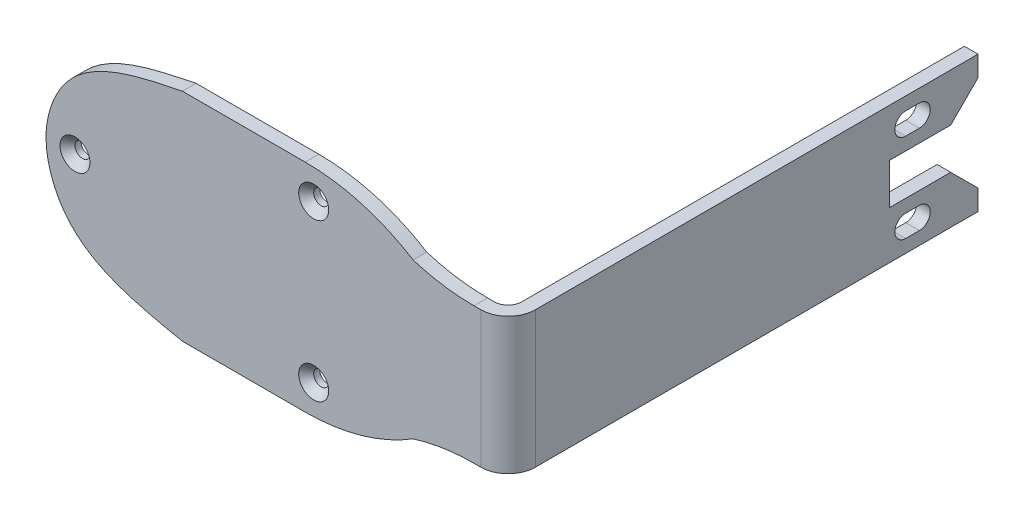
ISO-10303-21;
HEADER;
FILE_DESCRIPTION(('STEP AP214'),'2;1');
FILE_NAME('part.step','',(''),(''),'','','');
FILE_SCHEMA(('AUTOMOTIVE_DESIGN { 1 0 10303 214 1 1 1 1 }'));
ENDSEC;
DATA;
#1=APPLICATION_CONTEXT('core data for automotive mechanical design processes');
#2=APPLICATION_PROTOCOL_DEFINITION('international standard','automotive_design',2000,#1);
#3=PRODUCT_CONTEXT('',#1,'mechanical');
#4=PRODUCT('Part','Part','',(#3));
#5=PRODUCT_RELATED_PRODUCT_CATEGORY('part','',(#4));
#6=PRODUCT_DEFINITION_FORMATION('','',#4);
#7=PRODUCT_DEFINITION_CONTEXT('part definition',#1,'design');
#8=PRODUCT_DEFINITION('design','',#6,#7);
#9=PRODUCT_DEFINITION_SHAPE('','',#8);
#10=(LENGTH_UNIT() NAMED_UNIT(*) SI_UNIT(.MILLI.,.METRE.));
#11=(NAMED_UNIT(*) PLANE_ANGLE_UNIT() SI_UNIT($,.RADIAN.));
#12=(NAMED_UNIT(*) SI_UNIT($,.STERADIAN.) SOLID_ANGLE_UNIT());
#13=UNCERTAINTY_MEASURE_WITH_UNIT(LENGTH_MEASURE(1.E-05),#10,'distance_accuracy_value','');
#14=(GEOMETRIC_REPRESENTATION_CONTEXT(3) GLOBAL_UNCERTAINTY_ASSIGNED_CONTEXT((#13)) GLOBAL_UNIT_ASSIGNED_CONTEXT((#10,
#11,#12)) REPRESENTATION_CONTEXT('',''));
#15=CARTESIAN_POINT('',(0.,0.,0.));
#16=DIRECTION('',(0.,0.,1.));
#17=DIRECTION('',(1.,0.,0.));
#18=AXIS2_PLACEMENT_3D('',#15,#16,#17);
#19=CARTESIAN_POINT('',(-137.320474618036,17.986008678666,-66.9));
#20=DIRECTION('',(0.,0.,-1.));
#21=DIRECTION('',(-1.,0.,0.));
#22=AXIS2_PLACEMENT_3D('',#19,#20,#21);
#23=PLANE('',#22);
#24=DIRECTION('',(-1.,0.,0.));
#25=VECTOR('',#24,1.);
#26=CARTESIAN_POINT('',(-137.320474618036,20.9860086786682,-66.9));
#27=LINE('',#26,#25);
#28=CARTESIAN_POINT('',(-135.320474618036,20.9860086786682,-66.9));
#29=VERTEX_POINT('',#28);
#30=CARTESIAN_POINT('',(-137.320474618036,20.9860086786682,-66.9));
#31=VERTEX_POINT('',#30);
#32=EDGE_CURVE('E234',#29,#31,#27,.T.);
#33=ORIENTED_EDGE('',*,*,#32,.F.);
#34=DIRECTION('',(0.,1.,0.));
#35=VECTOR('',#34,1.);
#36=CARTESIAN_POINT('',(-135.320474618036,17.986008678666,-66.9));
#37=LINE('',#36,#35);
#38=CARTESIAN_POINT('',(-135.320474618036,17.986008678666,-66.9));
#39=VERTEX_POINT('',#38);
#40=EDGE_CURVE('E252',#39,#29,#37,.T.);
#41=ORIENTED_EDGE('',*,*,#40,.F.);
#42=DIRECTION('',(-1.,0.,0.));
#43=VECTOR('',#42,1.);
#44=CARTESIAN_POINT('',(-137.320474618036,17.986008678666,-66.9));
#45=LINE('',#44,#43);
#46=CARTESIAN_POINT('',(-137.320474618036,17.986008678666,-66.9));
#47=VERTEX_POINT('',#46);
#48=EDGE_CURVE('E253',#39,#47,#45,.T.);
#49=ORIENTED_EDGE('',*,*,#48,.T.);
#50=DIRECTION('',(0.,1.,0.));
#51=VECTOR('',#50,1.);
#52=CARTESIAN_POINT('',(-137.320474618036,17.986008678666,-66.9));
#53=LINE('',#52,#51);
#54=EDGE_CURVE('E261',#47,#31,#53,.T.);
#55=ORIENTED_EDGE('',*,*,#54,.T.);
#56=EDGE_LOOP('',(#33,#41,#49,#55));
#57=FACE_BOUND('',#56,.T.);
#58=ADVANCED_FACE('F34',(#57),#23,.T.);
#59=CARTESIAN_POINT('',(-140.313808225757,-12.0139913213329,2.));
#60=DIRECTION('',(0.,0.,-1.));
#61=DIRECTION('',(-1.,0.,0.));
#62=AXIS2_PLACEMENT_3D('',#59,#60,#61);
#63=CYLINDRICAL_SURFACE('',#62,30.);
#64=CARTESIAN_POINT('',(-140.313808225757,-12.0139913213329,0.));
#65=DIRECTION('',(0.,0.,-1.));
#66=DIRECTION('',(1.,0.,0.));
#67=AXIS2_PLACEMENT_3D('',#64,#65,#66);
#68=CIRCLE('',#67,30.);
#69=CARTESIAN_POINT('',(-149.241505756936,16.6268225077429,0.));
#70=VERTEX_POINT('',#69);
#71=CARTESIAN_POINT('',(-140.313808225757,17.9860086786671,0.));
#72=VERTEX_POINT('',#71);
#73=EDGE_CURVE('E262',#70,#72,#68,.T.);
#74=ORIENTED_EDGE('',*,*,#73,.T.);
#75=DIRECTION('',(0.,0.,-1.));
#76=VECTOR('',#75,1.);
#77=CARTESIAN_POINT('',(-140.313808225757,17.9860086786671,2.));
#78=LINE('',#77,#76);
#79=CARTESIAN_POINT('',(-140.313808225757,17.9860086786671,2.));
#80=VERTEX_POINT('',#79);
#81=EDGE_CURVE('E424',#80,#72,#78,.T.);
#82=ORIENTED_EDGE('',*,*,#81,.F.);
#83=CARTESIAN_POINT('',(-140.313808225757,-12.0139913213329,2.));
#84=DIRECTION('',(0.,0.,-1.));
#85=DIRECTION('',(1.,0.,0.));
#86=AXIS2_PLACEMENT_3D('',#83,#84,#85);
#87=CIRCLE('',#86,30.);
#88=CARTESIAN_POINT('',(-149.241505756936,16.6268225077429,2.));
#89=VERTEX_POINT('',#88);
#90=EDGE_CURVE('E296',#89,#80,#87,.T.);
#91=ORIENTED_EDGE('',*,*,#90,.F.);
#92=DIRECTION('',(0.,0.,-1.));
#93=VECTOR('',#92,1.);
#94=CARTESIAN_POINT('',(-149.241505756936,16.6268225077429,2.));
#95=LINE('',#94,#93);
#96=EDGE_CURVE('E416',#89,#70,#95,.T.);
#97=ORIENTED_EDGE('',*,*,#96,.T.);
#98=EDGE_LOOP('',(#74,#82,#91,#97));
#99=FACE_BOUND('',#98,.T.);
#100=ADVANCED_FACE('F36',(#99),#63,.F.);
#101=CARTESIAN_POINT('',(-135.320474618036,17.9860086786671,2.));
#102=DIRECTION('',(0.,1.,0.));
#103=DIRECTION('',(0.,0.,1.));
#104=AXIS2_PLACEMENT_3D('',#101,#102,#103);
#105=PLANE('',#104);
#106=DIRECTION('',(0.,0.,-1.));
#107=VECTOR('',#106,1.);
#108=CARTESIAN_POINT('',(-135.320474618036,17.9860086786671,2.));
#109=LINE('',#108,#107);
#110=CARTESIAN_POINT('',(-135.320474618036,17.9860086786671,-2.));
#111=VERTEX_POINT('',#110);
#112=EDGE_CURVE('E447',#111,#39,#109,.T.);
#113=ORIENTED_EDGE('',*,*,#112,.F.);
#114=CARTESIAN_POINT('',(-139.320474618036,17.9860086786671,-2.));
#115=DIRECTION('',(0.,1.,0.));
#116=DIRECTION('',(0.,0.,1.));
#117=AXIS2_PLACEMENT_3D('',#114,#115,#116);
#118=CIRCLE('',#117,4.);
#119=CARTESIAN_POINT('',(-139.320474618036,17.9860086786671,2.));
#120=VERTEX_POINT('',#119);
#121=EDGE_CURVE('E457',#111,#120,#118,.F.);
#122=ORIENTED_EDGE('',*,*,#121,.T.);
#123=DIRECTION('',(1.,0.,0.));
#124=VECTOR('',#123,1.);
#125=CARTESIAN_POINT('',(-135.320474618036,17.9860086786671,2.));
#126=LINE('',#125,#124);
#127=EDGE_CURVE('E299',#80,#120,#126,.T.);
#128=ORIENTED_EDGE('',*,*,#127,.F.);
#129=ORIENTED_EDGE('',*,*,#81,.T.);
#130=DIRECTION('',(1.,0.,0.));
#131=VECTOR('',#130,1.);
#132=CARTESIAN_POINT('',(-135.320474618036,17.9860086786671,0.));
#133=LINE('',#132,#131);
#134=CARTESIAN_POINT('',(-139.320474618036,17.9860086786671,0.));
#135=VERTEX_POINT('',#134);
#136=EDGE_CURVE('E265',#72,#135,#133,.T.);
#137=ORIENTED_EDGE('',*,*,#136,.T.);
#138=CARTESIAN_POINT('',(-139.320474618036,17.9860086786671,-2.));
#139=DIRECTION('',(0.,1.,0.));
#140=DIRECTION('',(0.,0.,1.));
#141=AXIS2_PLACEMENT_3D('',#138,#139,#140);
#142=CIRCLE('',#141,2.);
#143=CARTESIAN_POINT('',(-137.320474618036,17.986008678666,-2.));
#144=VERTEX_POINT('',#143);
#145=EDGE_CURVE('E463',#135,#144,#142,.T.);
#146=ORIENTED_EDGE('',*,*,#145,.T.);
#147=DIRECTION('',(0.,0.,1.));
#148=VECTOR('',#147,1.);
#149=CARTESIAN_POINT('',(-137.320474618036,17.986008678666,2.));
#150=LINE('',#149,#148);
#151=EDGE_CURVE('E257',#47,#144,#150,.T.);
#152=ORIENTED_EDGE('',*,*,#151,.F.);
#153=ORIENTED_EDGE('',*,*,#48,.F.);
#154=EDGE_LOOP('',(#113,#122,#128,#129,#137,#146,#152,#153));
#155=FACE_BOUND('',#154,.T.);
#156=ADVANCED_FACE('F348',(#155),#105,.F.);
#157=CARTESIAN_POINT('',(-135.320474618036,37.9860086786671,2.));
#158=DIRECTION('',(-1.,0.,0.));
#159=DIRECTION('',(0.,0.,1.));
#160=AXIS2_PLACEMENT_3D('',#157,#158,#159);
#161=PLANE('',#160);
#162=DIRECTION('',(0.,0.,-1.));
#163=VECTOR('',#162,1.);
#164=CARTESIAN_POINT('',(-135.320474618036,32.8860086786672,-56.3000000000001));
#165=LINE('',#164,#163);
#166=CARTESIAN_POINT('',(-135.320474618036,32.8860086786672,-56.3000000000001));
#167=VERTEX_POINT('',#166);
#168=CARTESIAN_POINT('',(-135.320474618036,32.8860086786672,-58.3));
#169=VERTEX_POINT('',#168);
#170=EDGE_CURVE('E530',#167,#169,#165,.T.);
#171=ORIENTED_EDGE('',*,*,#170,.F.);
#172=CARTESIAN_POINT('',(-135.320474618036,34.4860086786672,-56.3000000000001));
#173=DIRECTION('',(1.,0.,0.));
#174=DIRECTION('',(0.,0.,-1.));
#175=AXIS2_PLACEMENT_3D('',#172,#173,#174);
#176=CIRCLE('',#175,1.59999999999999);
#177=CARTESIAN_POINT('',(-135.320474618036,36.0860086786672,-56.3000000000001));
#178=VERTEX_POINT('',#177);
#179=EDGE_CURVE('E59',#178,#167,#176,.T.);
#180=ORIENTED_EDGE('',*,*,#179,.F.);
#181=DIRECTION('',(0.,0.,1.));
#182=VECTOR('',#181,1.);
#183=CARTESIAN_POINT('',(-135.320474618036,36.0860086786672,-56.3000000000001));
#184=LINE('',#183,#182);
#185=CARTESIAN_POINT('',(-135.320474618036,36.0860086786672,-58.3));
#186=VERTEX_POINT('',#185);
#187=EDGE_CURVE('E536',#186,#178,#184,.T.);
#188=ORIENTED_EDGE('',*,*,#187,.F.);
#189=CARTESIAN_POINT('',(-135.320474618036,34.4860086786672,-58.3));
#190=DIRECTION('',(1.,0.,0.));
#191=DIRECTION('',(0.,0.,1.));
#192=AXIS2_PLACEMENT_3D('',#189,#190,#191);
#193=CIRCLE('',#192,1.59999999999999);
#194=EDGE_CURVE('E533',#169,#186,#193,.T.);
#195=ORIENTED_EDGE('',*,*,#194,.F.);
#196=EDGE_LOOP('',(#171,#180,#188,#195));
#197=FACE_BOUND('',#196,.T.);
#198=DIRECTION('',(0.,0.,-1.));
#199=VECTOR('',#198,1.);
#200=CARTESIAN_POINT('',(-135.320474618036,19.8860086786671,-56.3000000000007));
#201=LINE('',#200,#199);
#202=CARTESIAN_POINT('',(-135.320474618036,19.8860086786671,-56.3000000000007));
#203=VERTEX_POINT('',#202);
#204=CARTESIAN_POINT('',(-135.320474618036,19.8860086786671,-58.3));
#205=VERTEX_POINT('',#204);
#206=EDGE_CURVE('E549',#203,#205,#201,.T.);
#207=ORIENTED_EDGE('',*,*,#206,.F.);
#208=CARTESIAN_POINT('',(-135.320474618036,21.4860086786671,-56.3000000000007));
#209=DIRECTION('',(1.,0.,0.));
#210=DIRECTION('',(0.,0.,-1.));
#211=AXIS2_PLACEMENT_3D('',#208,#209,#210);
#212=CIRCLE('',#211,1.6);
#213=CARTESIAN_POINT('',(-135.320474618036,23.0860086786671,-56.3000000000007));
#214=VERTEX_POINT('',#213);
#215=EDGE_CURVE('E542',#214,#203,#212,.T.);
#216=ORIENTED_EDGE('',*,*,#215,.F.);
#217=DIRECTION('',(0.,0.,1.));
#218=VECTOR('',#217,1.);
#219=CARTESIAN_POINT('',(-135.320474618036,23.0860086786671,-56.3000000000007));
#220=LINE('',#219,#218);
#221=CARTESIAN_POINT('',(-135.320474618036,23.0860086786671,-58.3));
#222=VERTEX_POINT('',#221);
#223=EDGE_CURVE('E555',#222,#214,#220,.T.);
#224=ORIENTED_EDGE('',*,*,#223,.F.);
#225=CARTESIAN_POINT('',(-135.320474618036,21.4860086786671,-58.3));
#226=DIRECTION('',(1.,0.,0.));
#227=DIRECTION('',(0.,0.,1.));
#228=AXIS2_PLACEMENT_3D('',#225,#226,#227);
#229=CIRCLE('',#228,1.6);
#230=EDGE_CURVE('E552',#205,#222,#229,.T.);
#231=ORIENTED_EDGE('',*,*,#230,.F.);
#232=EDGE_LOOP('',(#207,#216,#224,#231));
#233=FACE_BOUND('',#232,.T.);
#234=ORIENTED_EDGE('',*,*,#40,.T.);
#235=DIRECTION('',(0.,-0.707106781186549,-0.707106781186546));
#236=VECTOR('',#235,1.);
#237=CARTESIAN_POINT('',(-135.320474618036,24.9860086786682,-62.9));
#238=LINE('',#237,#236);
#239=CARTESIAN_POINT('',(-135.320474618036,24.9860086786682,-62.9));
#240=VERTEX_POINT('',#239);
#241=EDGE_CURVE('E516',#240,#29,#238,.T.);
#242=ORIENTED_EDGE('',*,*,#241,.F.);
#243=DIRECTION('',(0.,0.,-1.));
#244=VECTOR('',#243,1.);
#245=CARTESIAN_POINT('',(-135.320474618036,24.9860086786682,-53.9));
#246=LINE('',#245,#244);
#247=CARTESIAN_POINT('',(-135.320474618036,24.9860086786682,-53.9));
#248=VERTEX_POINT('',#247);
#249=EDGE_CURVE('E513',#248,#240,#246,.T.);
#250=ORIENTED_EDGE('',*,*,#249,.F.);
#251=DIRECTION('',(0.,-1.,0.));
#252=VECTOR('',#251,1.);
#253=CARTESIAN_POINT('',(-135.320474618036,30.9860086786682,-53.9));
#254=LINE('',#253,#252);
#255=CARTESIAN_POINT('',(-135.320474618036,30.9860086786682,-53.9));
#256=VERTEX_POINT('',#255);
#257=EDGE_CURVE('E510',#256,#248,#254,.T.);
#258=ORIENTED_EDGE('',*,*,#257,.F.);
#259=DIRECTION('',(0.,0.,1.));
#260=VECTOR('',#259,1.);
#261=CARTESIAN_POINT('',(-135.320474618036,30.9860086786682,-62.9));
#262=LINE('',#261,#260);
#263=CARTESIAN_POINT('',(-135.320474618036,30.9860086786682,-62.9));
#264=VERTEX_POINT('',#263);
#265=EDGE_CURVE('E245',#264,#256,#262,.T.);
#266=ORIENTED_EDGE('',*,*,#265,.F.);
#267=DIRECTION('',(0.,-0.707106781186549,0.707106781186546));
#268=VECTOR('',#267,1.);
#269=CARTESIAN_POINT('',(-135.320474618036,34.9860086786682,-66.9));
#270=LINE('',#269,#268);
#271=CARTESIAN_POINT('',(-135.320474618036,34.9860086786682,-66.9));
#272=VERTEX_POINT('',#271);
#273=EDGE_CURVE('E229',#272,#264,#270,.T.);
#274=ORIENTED_EDGE('',*,*,#273,.F.);
#275=CARTESIAN_POINT('',(-135.320474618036,37.986008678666,-66.9));
#276=VERTEX_POINT('',#275);
#277=EDGE_CURVE('E241',#272,#276,#37,.T.);
#278=ORIENTED_EDGE('',*,*,#277,.T.);
#279=DIRECTION('',(0.,0.,-1.));
#280=VECTOR('',#279,1.);
#281=CARTESIAN_POINT('',(-135.320474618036,37.9860086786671,2.));
#282=LINE('',#281,#280);
#283=CARTESIAN_POINT('',(-135.320474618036,37.9860086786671,-2.));
#284=VERTEX_POINT('',#283);
#285=EDGE_CURVE('E445',#284,#276,#282,.T.);
#286=ORIENTED_EDGE('',*,*,#285,.F.);
#287=DIRECTION('',(0.,1.,0.));
#288=VECTOR('',#287,1.);
#289=CARTESIAN_POINT('',(-135.320474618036,17.9860086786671,-2.));
#290=LINE('',#289,#288);
#291=EDGE_CURVE('E455',#284,#111,#290,.F.);
#292=ORIENTED_EDGE('',*,*,#291,.T.);
#293=ORIENTED_EDGE('',*,*,#112,.T.);
#294=EDGE_LOOP('',(#234,#242,#250,#258,#266,#274,#278,#286,#292,#293));
#295=FACE_BOUND('',#294,.T.);
#296=ADVANCED_FACE('F239',(#197,#233,#295),#161,.F.);
#297=CARTESIAN_POINT('',(-135.320474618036,37.9860086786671,2.));
#298=DIRECTION('',(0.,-1.,0.));
#299=DIRECTION('',(1.,0.,0.));
#300=AXIS2_PLACEMENT_3D('',#297,#298,#299);
#301=PLANE('',#300);
#302=DIRECTION('',(-1.,0.,0.));
#303=VECTOR('',#302,1.);
#304=CARTESIAN_POINT('',(-135.320474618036,37.9860086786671,2.));
#305=LINE('',#304,#303);
#306=CARTESIAN_POINT('',(-139.320474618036,37.9860086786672,2.));
#307=VERTEX_POINT('',#306);
#308=CARTESIAN_POINT('',(-140.313808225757,37.9860086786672,2.));
#309=VERTEX_POINT('',#308);
#310=EDGE_CURVE('E302',#307,#309,#305,.T.);
#311=ORIENTED_EDGE('',*,*,#310,.F.);
#312=CARTESIAN_POINT('',(-139.320474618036,37.9860086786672,-2.));
#313=DIRECTION('',(0.,-1.,0.));
#314=DIRECTION('',(1.,0.,0.));
#315=AXIS2_PLACEMENT_3D('',#312,#313,#314);
#316=CIRCLE('',#315,4.);
#317=EDGE_CURVE('E453',#307,#284,#316,.F.);
#318=ORIENTED_EDGE('',*,*,#317,.T.);
#319=ORIENTED_EDGE('',*,*,#285,.T.);
#320=DIRECTION('',(-1.,0.,0.));
#321=VECTOR('',#320,1.);
#322=CARTESIAN_POINT('',(-137.320474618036,37.986008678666,-66.9));
#323=LINE('',#322,#321);
#324=CARTESIAN_POINT('',(-137.320474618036,37.986008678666,-66.9));
#325=VERTEX_POINT('',#324);
#326=EDGE_CURVE('E251',#276,#325,#323,.T.);
#327=ORIENTED_EDGE('',*,*,#326,.T.);
#328=DIRECTION('',(0.,0.,1.));
#329=VECTOR('',#328,1.);
#330=CARTESIAN_POINT('',(-137.320474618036,37.986008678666,2.));
#331=LINE('',#330,#329);
#332=CARTESIAN_POINT('',(-137.320474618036,37.986008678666,-2.));
#333=VERTEX_POINT('',#332);
#334=EDGE_CURVE('E561',#325,#333,#331,.T.);
#335=ORIENTED_EDGE('',*,*,#334,.T.);
#336=CARTESIAN_POINT('',(-139.320474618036,37.9860086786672,-2.));
#337=DIRECTION('',(0.,-1.,0.));
#338=DIRECTION('',(1.,0.,0.));
#339=AXIS2_PLACEMENT_3D('',#336,#337,#338);
#340=CIRCLE('',#339,2.);
#341=CARTESIAN_POINT('',(-139.320474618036,37.9860086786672,0.));
#342=VERTEX_POINT('',#341);
#343=EDGE_CURVE('E465',#333,#342,#340,.T.);
#344=ORIENTED_EDGE('',*,*,#343,.T.);
#345=DIRECTION('',(-1.,0.,0.));
#346=VECTOR('',#345,1.);
#347=CARTESIAN_POINT('',(-135.320474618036,37.9860086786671,0.));
#348=LINE('',#347,#346);
#349=CARTESIAN_POINT('',(-140.313808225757,37.9860086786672,0.));
#350=VERTEX_POINT('',#349);
#351=EDGE_CURVE('E268',#342,#350,#348,.T.);
#352=ORIENTED_EDGE('',*,*,#351,.T.);
#353=DIRECTION('',(0.,0.,-1.));
#354=VECTOR('',#353,1.);
#355=CARTESIAN_POINT('',(-140.313808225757,37.9860086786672,2.));
#356=LINE('',#355,#354);
#357=EDGE_CURVE('E442',#309,#350,#356,.T.);
#358=ORIENTED_EDGE('',*,*,#357,.F.);
#359=EDGE_LOOP('',(#311,#318,#319,#327,#335,#344,#352,#358));
#360=FACE_BOUND('',#359,.T.);
#361=ADVANCED_FACE('F342',(#360),#301,.F.);
#362=CARTESIAN_POINT('',(-140.313808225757,67.9860086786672,2.));
#363=DIRECTION('',(0.,0.,-1.));
#364=DIRECTION('',(-1.,0.,0.));
#365=AXIS2_PLACEMENT_3D('',#362,#363,#364);
#366=CYLINDRICAL_SURFACE('',#365,30.);
#367=CARTESIAN_POINT('',(-140.313808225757,67.9860086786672,0.));
#368=DIRECTION('',(0.,0.,-1.));
#369=DIRECTION('',(-1.,0.,0.));
#370=AXIS2_PLACEMENT_3D('',#367,#368,#369);
#371=CIRCLE('',#370,30.);
#372=CARTESIAN_POINT('',(-149.241505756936,39.3451948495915,0.));
#373=VERTEX_POINT('',#372);
#374=EDGE_CURVE('E270',#350,#373,#371,.T.);
#375=ORIENTED_EDGE('',*,*,#374,.T.);
#376=DIRECTION('',(0.,0.,-1.));
#377=VECTOR('',#376,1.);
#378=CARTESIAN_POINT('',(-149.241505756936,39.3451948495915,2.));
#379=LINE('',#378,#377);
#380=CARTESIAN_POINT('',(-149.241505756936,39.3451948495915,2.));
#381=VERTEX_POINT('',#380);
#382=EDGE_CURVE('E439',#381,#373,#379,.T.);
#383=ORIENTED_EDGE('',*,*,#382,.F.);
#384=CARTESIAN_POINT('',(-140.313808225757,67.9860086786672,2.));
#385=DIRECTION('',(0.,0.,-1.));
#386=DIRECTION('',(-1.,0.,0.));
#387=AXIS2_PLACEMENT_3D('',#384,#385,#386);
#388=CIRCLE('',#387,30.);
#389=EDGE_CURVE('E304',#309,#381,#388,.T.);
#390=ORIENTED_EDGE('',*,*,#389,.F.);
#391=ORIENTED_EDGE('',*,*,#357,.T.);
#392=EDGE_LOOP('',(#375,#383,#390,#391));
#393=FACE_BOUND('',#392,.T.);
#394=ADVANCED_FACE('F338',(#393),#366,.F.);
#395=CARTESIAN_POINT('',(-165.070474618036,13.8610086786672,2.));
#396=DIRECTION('',(0.,0.,-1.));
#397=DIRECTION('',(-1.,0.,0.));
#398=AXIS2_PLACEMENT_3D('',#395,#396,#397);
#399=CYLINDRICAL_SURFACE('',#398,30.);
#400=CARTESIAN_POINT('',(-165.070474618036,13.8610086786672,0.));
#401=DIRECTION('',(0.,0.,1.));
#402=DIRECTION('',(1.,0.,0.));
#403=AXIS2_PLACEMENT_3D('',#400,#401,#402);
#404=CIRCLE('',#403,30.);
#405=CARTESIAN_POINT('',(-165.070474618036,43.8610086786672,0.));
#406=VERTEX_POINT('',#405);
#407=EDGE_CURVE('E272',#373,#406,#404,.T.);
#408=ORIENTED_EDGE('',*,*,#407,.T.);
#409=DIRECTION('',(0.,0.,-1.));
#410=VECTOR('',#409,1.);
#411=CARTESIAN_POINT('',(-165.070474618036,43.8610086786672,2.));
#412=LINE('',#411,#410);
#413=CARTESIAN_POINT('',(-165.070474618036,43.8610086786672,2.));
#414=VERTEX_POINT('',#413);
#415=EDGE_CURVE('E436',#414,#406,#412,.T.);
#416=ORIENTED_EDGE('',*,*,#415,.F.);
#417=CARTESIAN_POINT('',(-165.070474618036,13.8610086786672,2.));
#418=DIRECTION('',(0.,0.,1.));
#419=DIRECTION('',(1.,0.,0.));
#420=AXIS2_PLACEMENT_3D('',#417,#418,#419);
#421=CIRCLE('',#420,30.);
#422=EDGE_CURVE('E306',#381,#414,#421,.T.);
#423=ORIENTED_EDGE('',*,*,#422,.F.);
#424=ORIENTED_EDGE('',*,*,#382,.T.);
#425=EDGE_LOOP('',(#408,#416,#423,#424));
#426=FACE_BOUND('',#425,.T.);
#427=ADVANCED_FACE('F334',(#426),#399,.T.);
#428=CARTESIAN_POINT('',(-183.070474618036,43.8610086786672,2.));
#429=DIRECTION('',(0.,-1.,0.));
#430=DIRECTION('',(0.,0.,-1.));
#431=AXIS2_PLACEMENT_3D('',#428,#429,#430);
#432=PLANE('',#431);
#433=DIRECTION('',(-1.,0.,0.));
#434=VECTOR('',#433,1.);
#435=CARTESIAN_POINT('',(-183.070474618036,43.8610086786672,0.));
#436=LINE('',#435,#434);
#437=CARTESIAN_POINT('',(-183.070474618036,43.8610086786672,0.));
#438=VERTEX_POINT('',#437);
#439=EDGE_CURVE('E275',#406,#438,#436,.T.);
#440=ORIENTED_EDGE('',*,*,#439,.T.);
#441=DIRECTION('',(0.,0.,-1.));
#442=VECTOR('',#441,1.);
#443=CARTESIAN_POINT('',(-183.070474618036,43.8610086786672,2.));
#444=LINE('',#443,#442);
#445=CARTESIAN_POINT('',(-183.070474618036,43.8610086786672,2.));
#446=VERTEX_POINT('',#445);
#447=EDGE_CURVE('E433',#446,#438,#444,.T.);
#448=ORIENTED_EDGE('',*,*,#447,.F.);
#449=DIRECTION('',(-1.,0.,0.));
#450=VECTOR('',#449,1.);
#451=CARTESIAN_POINT('',(-165.070474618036,43.8610086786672,2.));
#452=LINE('',#451,#450);
#453=EDGE_CURVE('E308',#414,#446,#452,.T.);
#454=ORIENTED_EDGE('',*,*,#453,.F.);
#455=ORIENTED_EDGE('',*,*,#415,.T.);
#456=EDGE_LOOP('',(#440,#448,#454,#455));
#457=FACE_BOUND('',#456,.T.);
#458=ADVANCED_FACE('F329',(#457),#432,.F.);
#459=CARTESIAN_POINT('',(-183.070474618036,43.8610086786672,2.));
#460=CARTESIAN_POINT('',(-189.927347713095,42.4621210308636,2.));
#461=CARTESIAN_POINT('',(-199.808520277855,40.446238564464,2.));
#462=CARTESIAN_POINT('',(-203.070474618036,30.7917121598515,2.));
#463=CARTESIAN_POINT('',(-203.070474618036,27.9860086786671,2.));
#464=B_SPLINE_CURVE_WITH_KNOTS('',3,(#459,#460,#461,#462,#463),.UNSPECIFIED.,.F.,.F.,(4,1,4),
(0.,0.693933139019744,1.),.UNSPECIFIED.);
#465=DIRECTION('',(0.,0.,-1.));
#466=VECTOR('',#465,1.);
#467=SURFACE_OF_LINEAR_EXTRUSION('',#464,#466);
#468=CARTESIAN_POINT('',(-183.070474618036,43.8610086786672,0.));
#469=CARTESIAN_POINT('',(-189.927347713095,42.4621210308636,0.));
#470=CARTESIAN_POINT('',(-199.808520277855,40.446238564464,0.));
#471=CARTESIAN_POINT('',(-203.070474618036,30.7917121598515,0.));
#472=CARTESIAN_POINT('',(-203.070474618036,27.9860086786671,0.));
#473=B_SPLINE_CURVE_WITH_KNOTS('',3,(#468,#469,#470,#471,#472),.UNSPECIFIED.,.F.,.F.,(4,1,4),
(0.,0.693933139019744,1.),.UNSPECIFIED.);
#474=CARTESIAN_POINT('',(-203.070474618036,27.9860086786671,0.));
#475=VERTEX_POINT('',#474);
#476=EDGE_CURVE('E277',#438,#475,#473,.T.);
#477=ORIENTED_EDGE('',*,*,#476,.T.);
#478=DIRECTION('',(0.,0.,-1.));
#479=VECTOR('',#478,1.);
#480=CARTESIAN_POINT('',(-203.070474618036,27.9860086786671,2.));
#481=LINE('',#480,#479);
#482=CARTESIAN_POINT('',(-203.070474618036,27.9860086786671,2.));
#483=VERTEX_POINT('',#482);
#484=EDGE_CURVE('E430',#483,#475,#481,.T.);
#485=ORIENTED_EDGE('',*,*,#484,.F.);
#486=EDGE_CURVE('E310',#446,#483,#464,.T.);
#487=ORIENTED_EDGE('',*,*,#486,.F.);
#488=ORIENTED_EDGE('',*,*,#447,.T.);
#489=EDGE_LOOP('',(#477,#485,#487,#488));
#490=FACE_BOUND('',#489,.T.);
#491=ADVANCED_FACE('F324',(#490),#467,.F.);
#492=CARTESIAN_POINT('',(-203.070474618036,27.9860086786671,2.));
#493=CARTESIAN_POINT('',(-203.070474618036,25.1803051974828,2.));
#494=CARTESIAN_POINT('',(-199.808520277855,15.5257787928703,2.));
#495=CARTESIAN_POINT('',(-189.927347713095,13.5098963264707,2.));
#496=CARTESIAN_POINT('',(-183.070474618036,12.1110086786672,2.));
#497=B_SPLINE_CURVE_WITH_KNOTS('',3,(#492,#493,#494,#495,#496),.UNSPECIFIED.,.F.,.F.,(4,1,4),
(0.,0.306066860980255,1.),.UNSPECIFIED.);
#498=DIRECTION('',(0.,0.,-1.));
#499=VECTOR('',#498,1.);
#500=SURFACE_OF_LINEAR_EXTRUSION('',#497,#499);
#501=CARTESIAN_POINT('',(-203.070474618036,27.9860086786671,0.));
#502=CARTESIAN_POINT('',(-203.070474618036,25.1803051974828,0.));
#503=CARTESIAN_POINT('',(-199.808520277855,15.5257787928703,0.));
#504=CARTESIAN_POINT('',(-189.927347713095,13.5098963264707,0.));
#505=CARTESIAN_POINT('',(-183.070474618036,12.1110086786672,0.));
#506=B_SPLINE_CURVE_WITH_KNOTS('',3,(#501,#502,#503,#504,#505),.UNSPECIFIED.,.F.,.F.,(4,1,4),
(0.,0.306066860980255,1.),.UNSPECIFIED.);
#507=CARTESIAN_POINT('',(-183.070474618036,12.1110086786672,0.));
#508=VERTEX_POINT('',#507);
#509=EDGE_CURVE('E281',#475,#508,#506,.T.);
#510=ORIENTED_EDGE('',*,*,#509,.T.);
#511=DIRECTION('',(0.,0.,-1.));
#512=VECTOR('',#511,1.);
#513=CARTESIAN_POINT('',(-183.070474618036,12.1110086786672,2.));
#514=LINE('',#513,#512);
#515=CARTESIAN_POINT('',(-183.070474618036,12.1110086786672,2.));
#516=VERTEX_POINT('',#515);
#517=EDGE_CURVE('E409',#516,#508,#514,.T.);
#518=ORIENTED_EDGE('',*,*,#517,.F.);
#519=EDGE_CURVE('E315',#483,#516,#497,.T.);
#520=ORIENTED_EDGE('',*,*,#519,.F.);
#521=ORIENTED_EDGE('',*,*,#484,.T.);
#522=EDGE_LOOP('',(#510,#518,#520,#521));
#523=FACE_BOUND('',#522,.T.);
#524=ADVANCED_FACE('F328',(#523),#500,.F.);
#525=CARTESIAN_POINT('',(-165.070474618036,12.1110086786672,2.));
#526=DIRECTION('',(0.,1.,0.));
#527=DIRECTION('',(-1.,0.,0.));
#528=AXIS2_PLACEMENT_3D('',#525,#526,#527);
#529=PLANE('',#528);
#530=DIRECTION('',(1.,0.,0.));
#531=VECTOR('',#530,1.);
#532=CARTESIAN_POINT('',(-165.070474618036,12.1110086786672,0.));
#533=LINE('',#532,#531);
#534=CARTESIAN_POINT('',(-165.070474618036,12.1110086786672,0.));
#535=VERTEX_POINT('',#534);
#536=EDGE_CURVE('E289',#508,#535,#533,.T.);
#537=ORIENTED_EDGE('',*,*,#536,.T.);
#538=DIRECTION('',(0.,0.,-1.));
#539=VECTOR('',#538,1.);
#540=CARTESIAN_POINT('',(-165.070474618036,12.1110086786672,2.));
#541=LINE('',#540,#539);
#542=CARTESIAN_POINT('',(-165.070474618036,12.1110086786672,2.));
#543=VERTEX_POINT('',#542);
#544=EDGE_CURVE('E406',#543,#535,#541,.T.);
#545=ORIENTED_EDGE('',*,*,#544,.F.);
#546=DIRECTION('',(1.,0.,0.));
#547=VECTOR('',#546,1.);
#548=CARTESIAN_POINT('',(-183.070474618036,12.1110086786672,2.));
#549=LINE('',#548,#547);
#550=EDGE_CURVE('E426',#516,#543,#549,.T.);
#551=ORIENTED_EDGE('',*,*,#550,.F.);
#552=ORIENTED_EDGE('',*,*,#517,.T.);
#553=EDGE_LOOP('',(#537,#545,#551,#552));
#554=FACE_BOUND('',#553,.T.);
#555=ADVANCED_FACE('F393',(#554),#529,.F.);
#556=CARTESIAN_POINT('',(-165.070474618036,42.1110086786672,2.));
#557=DIRECTION('',(0.,0.,-1.));
#558=DIRECTION('',(-1.,0.,0.));
#559=AXIS2_PLACEMENT_3D('',#556,#557,#558);
#560=CYLINDRICAL_SURFACE('',#559,30.);
#561=CARTESIAN_POINT('',(-165.070474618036,42.1110086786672,0.));
#562=DIRECTION('',(0.,0.,1.));
#563=DIRECTION('',(-1.,0.,0.));
#564=AXIS2_PLACEMENT_3D('',#561,#562,#563);
#565=CIRCLE('',#564,30.);
#566=EDGE_CURVE('E294',#535,#70,#565,.T.);
#567=ORIENTED_EDGE('',*,*,#566,.T.);
#568=ORIENTED_EDGE('',*,*,#96,.F.);
#569=CARTESIAN_POINT('',(-165.070474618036,42.1110086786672,2.));
#570=DIRECTION('',(0.,0.,1.));
#571=DIRECTION('',(-1.,0.,0.));
#572=AXIS2_PLACEMENT_3D('',#569,#570,#571);
#573=CIRCLE('',#572,30.);
#574=EDGE_CURVE('E415',#543,#89,#573,.T.);
#575=ORIENTED_EDGE('',*,*,#574,.F.);
#576=ORIENTED_EDGE('',*,*,#544,.T.);
#577=EDGE_LOOP('',(#567,#568,#575,#576));
#578=FACE_BOUND('',#577,.T.);
#579=ADVANCED_FACE('F390',(#578),#560,.T.);
#580=CARTESIAN_POINT('',(-140.313808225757,-12.0139913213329,2.));
#581=DIRECTION('',(0.,0.,1.));
#582=DIRECTION('',(1.,0.,0.));
#583=AXIS2_PLACEMENT_3D('',#580,#581,#582);
#584=PLANE('',#583);
#585=CARTESIAN_POINT('',(-163.820474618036,16.4860086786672,2.));
#586=DIRECTION('',(0.,0.,1.));
#587=DIRECTION('',(1.,0.,0.));
#588=AXIS2_PLACEMENT_3D('',#585,#586,#587);
#589=CIRCLE('',#588,2.20000000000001);
#590=CARTESIAN_POINT('',(-161.620474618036,16.4860086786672,2.));
#591=VERTEX_POINT('',#590);
#592=EDGE_CURVE('E729',#591,#591,#589,.T.);
#593=ORIENTED_EDGE('',*,*,#592,.F.);
#594=EDGE_LOOP('',(#593));
#595=FACE_BOUND('',#594,.T.);
#596=CARTESIAN_POINT('',(-163.820474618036,39.4860086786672,2.));
#597=DIRECTION('',(0.,0.,1.));
#598=DIRECTION('',(1.,0.,0.));
#599=AXIS2_PLACEMENT_3D('',#596,#597,#598);
#600=CIRCLE('',#599,2.20000000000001);
#601=CARTESIAN_POINT('',(-161.620474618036,39.4860086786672,2.));
#602=VERTEX_POINT('',#601);
#603=EDGE_CURVE('E493',#602,#602,#600,.T.);
#604=ORIENTED_EDGE('',*,*,#603,.F.);
#605=EDGE_LOOP('',(#604));
#606=FACE_BOUND('',#605,.T.);
#607=CARTESIAN_POINT('',(-198.820474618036,27.9860086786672,2.));
#608=DIRECTION('',(0.,0.,1.));
#609=DIRECTION('',(1.,0.,0.));
#610=AXIS2_PLACEMENT_3D('',#607,#608,#609);
#611=CIRCLE('',#610,2.20000000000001);
#612=CARTESIAN_POINT('',(-196.620474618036,27.9860086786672,2.));
#613=VERTEX_POINT('',#612);
#614=EDGE_CURVE('E492',#613,#613,#611,.T.);
#615=ORIENTED_EDGE('',*,*,#614,.F.);
#616=EDGE_LOOP('',(#615));
#617=FACE_BOUND('',#616,.T.);
#618=ORIENTED_EDGE('',*,*,#127,.T.);
#619=DIRECTION('',(0.,1.,0.));
#620=VECTOR('',#619,1.);
#621=CARTESIAN_POINT('',(-139.320474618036,37.9860086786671,2.));
#622=LINE('',#621,#620);
#623=EDGE_CURVE('E450',#120,#307,#622,.T.);
#624=ORIENTED_EDGE('',*,*,#623,.T.);
#625=ORIENTED_EDGE('',*,*,#310,.T.);
#626=ORIENTED_EDGE('',*,*,#389,.T.);
#627=ORIENTED_EDGE('',*,*,#422,.T.);
#628=ORIENTED_EDGE('',*,*,#453,.T.);
#629=ORIENTED_EDGE('',*,*,#486,.T.);
#630=ORIENTED_EDGE('',*,*,#519,.T.);
#631=ORIENTED_EDGE('',*,*,#550,.T.);
#632=ORIENTED_EDGE('',*,*,#574,.T.);
#633=ORIENTED_EDGE('',*,*,#90,.T.);
#634=EDGE_LOOP('',(#618,#624,#625,#626,#627,#628,#629,#630,#631,#632,#633));
#635=FACE_BOUND('',#634,.T.);
#636=ADVANCED_FACE('F382',(#595,#606,#617,#635),#584,.T.);
#637=CARTESIAN_POINT('',(-140.313808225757,-12.0139913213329,0.));
#638=DIRECTION('',(0.,0.,1.));
#639=DIRECTION('',(1.,0.,0.));
#640=AXIS2_PLACEMENT_3D('',#637,#638,#639);
#641=PLANE('',#640);
#642=CARTESIAN_POINT('',(-163.820474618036,16.4860086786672,0.));
#643=DIRECTION('',(0.,0.,1.));
#644=DIRECTION('',(1.,0.,0.));
#645=AXIS2_PLACEMENT_3D('',#642,#643,#644);
#646=CIRCLE('',#645,1.09999999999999);
#647=CARTESIAN_POINT('',(-162.720474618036,16.4860086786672,0.));
#648=VERTEX_POINT('',#647);
#649=EDGE_CURVE('E38',#648,#648,#646,.T.);
#650=ORIENTED_EDGE('',*,*,#649,.T.);
#651=EDGE_LOOP('',(#650));
#652=FACE_BOUND('',#651,.T.);
#653=CARTESIAN_POINT('',(-163.820474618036,39.4860086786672,0.));
#654=DIRECTION('',(0.,0.,1.));
#655=DIRECTION('',(1.,0.,0.));
#656=AXIS2_PLACEMENT_3D('',#653,#654,#655);
#657=CIRCLE('',#656,1.09999999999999);
#658=CARTESIAN_POINT('',(-162.720474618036,39.4860086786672,0.));
#659=VERTEX_POINT('',#658);
#660=EDGE_CURVE('E490',#659,#659,#657,.T.);
#661=ORIENTED_EDGE('',*,*,#660,.T.);
#662=EDGE_LOOP('',(#661));
#663=FACE_BOUND('',#662,.T.);
#664=CARTESIAN_POINT('',(-198.820474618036,27.9860086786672,0.));
#665=DIRECTION('',(0.,0.,1.));
#666=DIRECTION('',(1.,0.,0.));
#667=AXIS2_PLACEMENT_3D('',#664,#665,#666);
#668=CIRCLE('',#667,1.09999999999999);
#669=CARTESIAN_POINT('',(-197.720474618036,27.9860086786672,0.));
#670=VERTEX_POINT('',#669);
#671=EDGE_CURVE('E246',#670,#670,#668,.T.);
#672=ORIENTED_EDGE('',*,*,#671,.T.);
#673=EDGE_LOOP('',(#672));
#674=FACE_BOUND('',#673,.T.);
#675=ORIENTED_EDGE('',*,*,#351,.F.);
#676=DIRECTION('',(0.,-1.,0.));
#677=VECTOR('',#676,1.);
#678=CARTESIAN_POINT('',(-139.320474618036,-12.0139913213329,0.));
#679=LINE('',#678,#677);
#680=EDGE_CURVE('E459',#342,#135,#679,.T.);
#681=ORIENTED_EDGE('',*,*,#680,.T.);
#682=ORIENTED_EDGE('',*,*,#136,.F.);
#683=ORIENTED_EDGE('',*,*,#73,.F.);
#684=ORIENTED_EDGE('',*,*,#566,.F.);
#685=ORIENTED_EDGE('',*,*,#536,.F.);
#686=ORIENTED_EDGE('',*,*,#509,.F.);
#687=ORIENTED_EDGE('',*,*,#476,.F.);
#688=ORIENTED_EDGE('',*,*,#439,.F.);
#689=ORIENTED_EDGE('',*,*,#407,.F.);
#690=ORIENTED_EDGE('',*,*,#374,.F.);
#691=EDGE_LOOP('',(#675,#681,#682,#683,#684,#685,#686,#687,#688,#689,#690));
#692=FACE_BOUND('',#691,.T.);
#693=ADVANCED_FACE('F378',(#652,#663,#674,#692),#641,.F.);
#694=CARTESIAN_POINT('',(-137.320474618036,17.986008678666,2.));
#695=DIRECTION('',(-1.,0.,0.));
#696=DIRECTION('',(0.,0.,1.));
#697=AXIS2_PLACEMENT_3D('',#694,#695,#696);
#698=PLANE('',#697);
#699=DIRECTION('',(0.,0.707106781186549,0.707106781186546));
#700=VECTOR('',#699,1.);
#701=CARTESIAN_POINT('',(-137.320474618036,53.9360086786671,-33.9500000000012));
#702=LINE('',#701,#700);
#703=CARTESIAN_POINT('',(-137.320474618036,24.9860086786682,-62.9));
#704=VERTEX_POINT('',#703);
#705=EDGE_CURVE('E527',#31,#704,#702,.T.);
#706=ORIENTED_EDGE('',*,*,#705,.F.);
#707=ORIENTED_EDGE('',*,*,#54,.F.);
#708=ORIENTED_EDGE('',*,*,#151,.T.);
#709=DIRECTION('',(0.,-1.,0.));
#710=VECTOR('',#709,1.);
#711=CARTESIAN_POINT('',(-137.320474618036,17.986008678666,-2.));
#712=LINE('',#711,#710);
#713=EDGE_CURVE('E461',#144,#333,#712,.F.);
#714=ORIENTED_EDGE('',*,*,#713,.T.);
#715=ORIENTED_EDGE('',*,*,#334,.F.);
#716=CARTESIAN_POINT('',(-137.320474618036,34.9860086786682,-66.9));
#717=VERTEX_POINT('',#716);
#718=EDGE_CURVE('E255',#717,#325,#53,.T.);
#719=ORIENTED_EDGE('',*,*,#718,.F.);
#720=DIRECTION('',(0.,0.707106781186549,-0.707106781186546));
#721=VECTOR('',#720,1.);
#722=CARTESIAN_POINT('',(-137.320474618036,-7.96399132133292,-23.949999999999));
#723=LINE('',#722,#721);
#724=CARTESIAN_POINT('',(-137.320474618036,30.9860086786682,-62.9));
#725=VERTEX_POINT('',#724);
#726=EDGE_CURVE('E51',#725,#717,#723,.T.);
#727=ORIENTED_EDGE('',*,*,#726,.F.);
#728=DIRECTION('',(0.,0.,-1.));
#729=VECTOR('',#728,1.);
#730=CARTESIAN_POINT('',(-137.320474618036,30.9860086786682,2.));
#731=LINE('',#730,#729);
#732=CARTESIAN_POINT('',(-137.320474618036,30.9860086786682,-53.9));
#733=VERTEX_POINT('',#732);
#734=EDGE_CURVE('E485',#733,#725,#731,.T.);
#735=ORIENTED_EDGE('',*,*,#734,.F.);
#736=DIRECTION('',(0.,1.,0.));
#737=VECTOR('',#736,1.);
#738=CARTESIAN_POINT('',(-137.320474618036,17.986008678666,-53.9));
#739=LINE('',#738,#737);
#740=CARTESIAN_POINT('',(-137.320474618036,24.9860086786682,-53.9));
#741=VERTEX_POINT('',#740);
#742=EDGE_CURVE('E43',#741,#733,#739,.T.);
#743=ORIENTED_EDGE('',*,*,#742,.F.);
#744=DIRECTION('',(0.,0.,1.));
#745=VECTOR('',#744,1.);
#746=CARTESIAN_POINT('',(-137.320474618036,24.9860086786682,2.));
#747=LINE('',#746,#745);
#748=EDGE_CURVE('E13',#704,#741,#747,.T.);
#749=ORIENTED_EDGE('',*,*,#748,.F.);
#750=EDGE_LOOP('',(#706,#707,#708,#714,#715,#719,#727,#735,#743,#749));
#751=FACE_BOUND('',#750,.T.);
#752=CARTESIAN_POINT('',(-137.320474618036,34.4860086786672,-56.3000000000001));
#753=DIRECTION('',(-1.,0.,0.));
#754=DIRECTION('',(0.,0.,1.));
#755=AXIS2_PLACEMENT_3D('',#752,#753,#754);
#756=CIRCLE('',#755,1.59999999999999);
#757=CARTESIAN_POINT('',(-137.320474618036,32.8860086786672,-56.3000000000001));
#758=VERTEX_POINT('',#757);
#759=CARTESIAN_POINT('',(-137.320474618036,36.0860086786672,-56.3000000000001));
#760=VERTEX_POINT('',#759);
#761=EDGE_CURVE('E235',#758,#760,#756,.T.);
#762=ORIENTED_EDGE('',*,*,#761,.F.);
#763=DIRECTION('',(0.,0.,1.));
#764=VECTOR('',#763,1.);
#765=CARTESIAN_POINT('',(-137.320474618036,32.8860086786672,2.));
#766=LINE('',#765,#764);
#767=CARTESIAN_POINT('',(-137.320474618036,32.8860086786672,-58.3));
#768=VERTEX_POINT('',#767);
#769=EDGE_CURVE('E476',#768,#758,#766,.T.);
#770=ORIENTED_EDGE('',*,*,#769,.F.);
#771=CARTESIAN_POINT('',(-137.320474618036,34.4860086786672,-58.3));
#772=DIRECTION('',(-1.,0.,0.));
#773=DIRECTION('',(0.,0.,1.));
#774=AXIS2_PLACEMENT_3D('',#771,#772,#773);
#775=CIRCLE('',#774,1.59999999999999);
#776=CARTESIAN_POINT('',(-137.320474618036,36.0860086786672,-58.3));
#777=VERTEX_POINT('',#776);
#778=EDGE_CURVE('E478',#777,#768,#775,.T.);
#779=ORIENTED_EDGE('',*,*,#778,.F.);
#780=DIRECTION('',(0.,0.,-1.));
#781=VECTOR('',#780,1.);
#782=CARTESIAN_POINT('',(-137.320474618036,36.0860086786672,2.));
#783=LINE('',#782,#781);
#784=EDGE_CURVE('E481',#760,#777,#783,.T.);
#785=ORIENTED_EDGE('',*,*,#784,.F.);
#786=EDGE_LOOP('',(#762,#770,#779,#785));
#787=FACE_BOUND('',#786,.T.);
#788=CARTESIAN_POINT('',(-137.320474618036,21.4860086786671,-56.3000000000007));
#789=DIRECTION('',(-1.,0.,0.));
#790=DIRECTION('',(0.,0.,1.));
#791=AXIS2_PLACEMENT_3D('',#788,#789,#790);
#792=CIRCLE('',#791,1.6);
#793=CARTESIAN_POINT('',(-137.320474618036,19.8860086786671,-56.3000000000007));
#794=VERTEX_POINT('',#793);
#795=CARTESIAN_POINT('',(-137.320474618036,23.0860086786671,-56.3000000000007));
#796=VERTEX_POINT('',#795);
#797=EDGE_CURVE('E474',#794,#796,#792,.T.);
#798=ORIENTED_EDGE('',*,*,#797,.F.);
#799=DIRECTION('',(0.,0.,1.));
#800=VECTOR('',#799,1.);
#801=CARTESIAN_POINT('',(-137.320474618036,19.886008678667,2.));
#802=LINE('',#801,#800);
#803=CARTESIAN_POINT('',(-137.320474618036,19.8860086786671,-58.3));
#804=VERTEX_POINT('',#803);
#805=EDGE_CURVE('E467',#804,#794,#802,.T.);
#806=ORIENTED_EDGE('',*,*,#805,.F.);
#807=CARTESIAN_POINT('',(-137.320474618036,21.4860086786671,-58.3));
#808=DIRECTION('',(-1.,0.,0.));
#809=DIRECTION('',(0.,0.,1.));
#810=AXIS2_PLACEMENT_3D('',#807,#808,#809);
#811=CIRCLE('',#810,1.6);
#812=CARTESIAN_POINT('',(-137.320474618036,23.0860086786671,-58.3));
#813=VERTEX_POINT('',#812);
#814=EDGE_CURVE('E469',#813,#804,#811,.T.);
#815=ORIENTED_EDGE('',*,*,#814,.F.);
#816=DIRECTION('',(0.,0.,-1.));
#817=VECTOR('',#816,1.);
#818=CARTESIAN_POINT('',(-137.320474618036,23.0860086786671,2.));
#819=LINE('',#818,#817);
#820=EDGE_CURVE('E472',#796,#813,#819,.T.);
#821=ORIENTED_EDGE('',*,*,#820,.F.);
#822=EDGE_LOOP('',(#798,#806,#815,#821));
#823=FACE_BOUND('',#822,.T.);
#824=ADVANCED_FACE('F371',(#751,#787,#823),#698,.T.);
#825=DIRECTION('',(1.,0.,0.));
#826=VECTOR('',#825,1.);
#827=CARTESIAN_POINT('',(-137.320474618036,34.9860086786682,-66.9));
#828=LINE('',#827,#826);
#829=EDGE_CURVE('E226',#717,#272,#828,.T.);
#830=ORIENTED_EDGE('',*,*,#829,.F.);
#831=ORIENTED_EDGE('',*,*,#718,.T.);
#832=ORIENTED_EDGE('',*,*,#326,.F.);
#833=ORIENTED_EDGE('',*,*,#277,.F.);
#834=EDGE_LOOP('',(#830,#831,#832,#833));
#835=FACE_BOUND('',#834,.T.);
#836=ADVANCED_FACE('F249',(#835),#23,.T.);
#837=CARTESIAN_POINT('',(-139.320474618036,-12.0139913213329,-2.));
#838=DIRECTION('',(0.,-1.,0.));
#839=DIRECTION('',(0.,0.,-1.));
#840=AXIS2_PLACEMENT_3D('',#837,#838,#839);
#841=CYLINDRICAL_SURFACE('',#840,4.);
#842=ORIENTED_EDGE('',*,*,#121,.F.);
#843=ORIENTED_EDGE('',*,*,#291,.F.);
#844=ORIENTED_EDGE('',*,*,#317,.F.);
#845=ORIENTED_EDGE('',*,*,#623,.F.);
#846=EDGE_LOOP('',(#842,#843,#844,#845));
#847=FACE_BOUND('',#846,.T.);
#848=ADVANCED_FACE('F370',(#847),#841,.T.);
#849=CARTESIAN_POINT('',(-139.320474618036,-12.0139913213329,-2.));
#850=DIRECTION('',(0.,-1.,0.));
#851=DIRECTION('',(1.,0.,0.));
#852=AXIS2_PLACEMENT_3D('',#849,#850,#851);
#853=CYLINDRICAL_SURFACE('',#852,2.);
#854=ORIENTED_EDGE('',*,*,#343,.F.);
#855=ORIENTED_EDGE('',*,*,#713,.F.);
#856=ORIENTED_EDGE('',*,*,#145,.F.);
#857=ORIENTED_EDGE('',*,*,#680,.F.);
#858=EDGE_LOOP('',(#854,#855,#856,#857));
#859=FACE_BOUND('',#858,.T.);
#860=ADVANCED_FACE('F376',(#859),#853,.F.);
#861=CARTESIAN_POINT('',(-203.070474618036,21.4860086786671,-56.3000000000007));
#862=DIRECTION('',(1.,0.,0.));
#863=DIRECTION('',(0.,0.,-1.));
#864=AXIS2_PLACEMENT_3D('',#861,#862,#863);
#865=CYLINDRICAL_SURFACE('',#864,1.6);
#866=ORIENTED_EDGE('',*,*,#797,.T.);
#867=DIRECTION('',(1.,0.,0.));
#868=VECTOR('',#867,1.);
#869=CARTESIAN_POINT('',(-203.070474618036,23.0860086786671,-56.3000000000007));
#870=LINE('',#869,#868);
#871=EDGE_CURVE('E559',#796,#214,#870,.T.);
#872=ORIENTED_EDGE('',*,*,#871,.T.);
#873=ORIENTED_EDGE('',*,*,#215,.T.);
#874=DIRECTION('',(1.,0.,0.));
#875=VECTOR('',#874,1.);
#876=CARTESIAN_POINT('',(-203.070474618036,19.8860086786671,-56.3000000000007));
#877=LINE('',#876,#875);
#878=EDGE_CURVE('E558',#794,#203,#877,.T.);
#879=ORIENTED_EDGE('',*,*,#878,.F.);
#880=EDGE_LOOP('',(#866,#872,#873,#879));
#881=FACE_BOUND('',#880,.T.);
#882=ADVANCED_FACE('F646',(#881),#865,.F.);
#883=CARTESIAN_POINT('',(-203.070474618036,23.0860086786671,-56.3000000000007));
#884=DIRECTION('',(0.,1.,0.));
#885=DIRECTION('',(0.,0.,1.));
#886=AXIS2_PLACEMENT_3D('',#883,#884,#885);
#887=PLANE('',#886);
#888=ORIENTED_EDGE('',*,*,#820,.T.);
#889=DIRECTION('',(1.,0.,0.));
#890=VECTOR('',#889,1.);
#891=CARTESIAN_POINT('',(-203.070474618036,23.0860086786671,-58.3));
#892=LINE('',#891,#890);
#893=EDGE_CURVE('E562',#813,#222,#892,.T.);
#894=ORIENTED_EDGE('',*,*,#893,.T.);
#895=ORIENTED_EDGE('',*,*,#223,.T.);
#896=ORIENTED_EDGE('',*,*,#871,.F.);
#897=EDGE_LOOP('',(#888,#894,#895,#896));
#898=FACE_BOUND('',#897,.T.);
#899=ADVANCED_FACE('F642',(#898),#887,.F.);
#900=CARTESIAN_POINT('',(-203.070474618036,21.4860086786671,-58.3));
#901=DIRECTION('',(1.,0.,0.));
#902=DIRECTION('',(0.,0.,-1.));
#903=AXIS2_PLACEMENT_3D('',#900,#901,#902);
#904=CYLINDRICAL_SURFACE('',#903,1.6);
#905=ORIENTED_EDGE('',*,*,#814,.T.);
#906=DIRECTION('',(1.,0.,0.));
#907=VECTOR('',#906,1.);
#908=CARTESIAN_POINT('',(-203.070474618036,19.8860086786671,-58.3));
#909=LINE('',#908,#907);
#910=EDGE_CURVE('E564',#804,#205,#909,.T.);
#911=ORIENTED_EDGE('',*,*,#910,.T.);
#912=ORIENTED_EDGE('',*,*,#230,.T.);
#913=ORIENTED_EDGE('',*,*,#893,.F.);
#914=EDGE_LOOP('',(#905,#911,#912,#913));
#915=FACE_BOUND('',#914,.T.);
#916=ADVANCED_FACE('F645',(#915),#904,.F.);
#917=CARTESIAN_POINT('',(-203.070474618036,19.8860086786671,-56.3000000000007));
#918=DIRECTION('',(0.,-1.,0.));
#919=DIRECTION('',(0.,0.,-1.));
#920=AXIS2_PLACEMENT_3D('',#917,#918,#919);
#921=PLANE('',#920);
#922=ORIENTED_EDGE('',*,*,#805,.T.);
#923=ORIENTED_EDGE('',*,*,#878,.T.);
#924=ORIENTED_EDGE('',*,*,#206,.T.);
#925=ORIENTED_EDGE('',*,*,#910,.F.);
#926=EDGE_LOOP('',(#922,#923,#924,#925));
#927=FACE_BOUND('',#926,.T.);
#928=ADVANCED_FACE('F641',(#927),#921,.F.);
#929=CARTESIAN_POINT('',(-203.070474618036,34.4860086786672,-56.3000000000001));
#930=DIRECTION('',(1.,0.,0.));
#931=DIRECTION('',(0.,0.,-1.));
#932=AXIS2_PLACEMENT_3D('',#929,#930,#931);
#933=CYLINDRICAL_SURFACE('',#932,1.59999999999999);
#934=ORIENTED_EDGE('',*,*,#761,.T.);
#935=DIRECTION('',(1.,0.,0.));
#936=VECTOR('',#935,1.);
#937=CARTESIAN_POINT('',(-203.070474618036,36.0860086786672,-56.3000000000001));
#938=LINE('',#937,#936);
#939=EDGE_CURVE('E540',#760,#178,#938,.T.);
#940=ORIENTED_EDGE('',*,*,#939,.T.);
#941=ORIENTED_EDGE('',*,*,#179,.T.);
#942=DIRECTION('',(1.,0.,0.));
#943=VECTOR('',#942,1.);
#944=CARTESIAN_POINT('',(-203.070474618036,32.8860086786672,-56.3000000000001));
#945=LINE('',#944,#943);
#946=EDGE_CURVE('E539',#758,#167,#945,.T.);
#947=ORIENTED_EDGE('',*,*,#946,.F.);
#948=EDGE_LOOP('',(#934,#940,#941,#947));
#949=FACE_BOUND('',#948,.T.);
#950=ADVANCED_FACE('F630',(#949),#933,.F.);
#951=CARTESIAN_POINT('',(-203.070474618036,36.0860086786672,-56.3000000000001));
#952=DIRECTION('',(0.,1.,0.));
#953=DIRECTION('',(0.,0.,1.));
#954=AXIS2_PLACEMENT_3D('',#951,#952,#953);
#955=PLANE('',#954);
#956=ORIENTED_EDGE('',*,*,#784,.T.);
#957=DIRECTION('',(1.,0.,0.));
#958=VECTOR('',#957,1.);
#959=CARTESIAN_POINT('',(-203.070474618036,36.0860086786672,-58.3));
#960=LINE('',#959,#958);
#961=EDGE_CURVE('E543',#777,#186,#960,.T.);
#962=ORIENTED_EDGE('',*,*,#961,.T.);
#963=ORIENTED_EDGE('',*,*,#187,.T.);
#964=ORIENTED_EDGE('',*,*,#939,.F.);
#965=EDGE_LOOP('',(#956,#962,#963,#964));
#966=FACE_BOUND('',#965,.T.);
#967=ADVANCED_FACE('F626',(#966),#955,.F.);
#968=CARTESIAN_POINT('',(-203.070474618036,34.4860086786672,-58.3));
#969=DIRECTION('',(1.,0.,0.));
#970=DIRECTION('',(0.,0.,-1.));
#971=AXIS2_PLACEMENT_3D('',#968,#969,#970);
#972=CYLINDRICAL_SURFACE('',#971,1.59999999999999);
#973=ORIENTED_EDGE('',*,*,#778,.T.);
#974=DIRECTION('',(1.,0.,0.));
#975=VECTOR('',#974,1.);
#976=CARTESIAN_POINT('',(-203.070474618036,32.8860086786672,-58.3));
#977=LINE('',#976,#975);
#978=EDGE_CURVE('E545',#768,#169,#977,.T.);
#979=ORIENTED_EDGE('',*,*,#978,.T.);
#980=ORIENTED_EDGE('',*,*,#194,.T.);
#981=ORIENTED_EDGE('',*,*,#961,.F.);
#982=EDGE_LOOP('',(#973,#979,#980,#981));
#983=FACE_BOUND('',#982,.T.);
#984=ADVANCED_FACE('F629',(#983),#972,.F.);
#985=CARTESIAN_POINT('',(-203.070474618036,32.8860086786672,-56.3000000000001));
#986=DIRECTION('',(0.,-1.,0.));
#987=DIRECTION('',(0.,0.,-1.));
#988=AXIS2_PLACEMENT_3D('',#985,#986,#987);
#989=PLANE('',#988);
#990=ORIENTED_EDGE('',*,*,#769,.T.);
#991=ORIENTED_EDGE('',*,*,#946,.T.);
#992=ORIENTED_EDGE('',*,*,#170,.T.);
#993=ORIENTED_EDGE('',*,*,#978,.F.);
#994=EDGE_LOOP('',(#990,#991,#992,#993));
#995=FACE_BOUND('',#994,.T.);
#996=ADVANCED_FACE('F634',(#995),#989,.F.);
#997=CARTESIAN_POINT('',(-203.070474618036,24.9860086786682,-62.9));
#998=DIRECTION('',(0.,-0.707106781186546,0.707106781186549));
#999=DIRECTION('',(0.,-0.707106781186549,-0.707106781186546));
#1000=AXIS2_PLACEMENT_3D('',#997,#998,#999);
#1001=PLANE('',#1000);
#1002=ORIENTED_EDGE('',*,*,#705,.T.);
#1003=DIRECTION('',(1.,0.,0.));
#1004=VECTOR('',#1003,1.);
#1005=CARTESIAN_POINT('',(-203.070474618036,24.9860086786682,-62.9));
#1006=LINE('',#1005,#1004);
#1007=EDGE_CURVE('E519',#704,#240,#1006,.T.);
#1008=ORIENTED_EDGE('',*,*,#1007,.T.);
#1009=ORIENTED_EDGE('',*,*,#241,.T.);
#1010=ORIENTED_EDGE('',*,*,#32,.T.);
#1011=EDGE_LOOP('',(#1002,#1008,#1009,#1010));
#1012=FACE_BOUND('',#1011,.T.);
#1013=ADVANCED_FACE('F601',(#1012),#1001,.F.);
#1014=CARTESIAN_POINT('',(-203.070474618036,24.9860086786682,-53.9));
#1015=DIRECTION('',(0.,-1.,0.));
#1016=DIRECTION('',(0.,0.,-1.));
#1017=AXIS2_PLACEMENT_3D('',#1014,#1015,#1016);
#1018=PLANE('',#1017);
#1019=ORIENTED_EDGE('',*,*,#748,.T.);
#1020=DIRECTION('',(1.,0.,0.));
#1021=VECTOR('',#1020,1.);
#1022=CARTESIAN_POINT('',(-203.070474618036,24.9860086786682,-53.9));
#1023=LINE('',#1022,#1021);
#1024=EDGE_CURVE('E521',#741,#248,#1023,.T.);
#1025=ORIENTED_EDGE('',*,*,#1024,.T.);
#1026=ORIENTED_EDGE('',*,*,#249,.T.);
#1027=ORIENTED_EDGE('',*,*,#1007,.F.);
#1028=EDGE_LOOP('',(#1019,#1025,#1026,#1027));
#1029=FACE_BOUND('',#1028,.T.);
#1030=ADVANCED_FACE('F608',(#1029),#1018,.F.);
#1031=CARTESIAN_POINT('',(-203.070474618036,30.9860086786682,-53.9));
#1032=DIRECTION('',(0.,0.,1.));
#1033=DIRECTION('',(1.,0.,0.));
#1034=AXIS2_PLACEMENT_3D('',#1031,#1032,#1033);
#1035=PLANE('',#1034);
#1036=ORIENTED_EDGE('',*,*,#742,.T.);
#1037=DIRECTION('',(1.,0.,0.));
#1038=VECTOR('',#1037,1.);
#1039=CARTESIAN_POINT('',(-203.070474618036,30.9860086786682,-53.9));
#1040=LINE('',#1039,#1038);
#1041=EDGE_CURVE('E523',#733,#256,#1040,.T.);
#1042=ORIENTED_EDGE('',*,*,#1041,.T.);
#1043=ORIENTED_EDGE('',*,*,#257,.T.);
#1044=ORIENTED_EDGE('',*,*,#1024,.F.);
#1045=EDGE_LOOP('',(#1036,#1042,#1043,#1044));
#1046=FACE_BOUND('',#1045,.T.);
#1047=ADVANCED_FACE('F610',(#1046),#1035,.F.);
#1048=CARTESIAN_POINT('',(-203.070474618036,30.9860086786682,-62.9));
#1049=DIRECTION('',(0.,1.,0.));
#1050=DIRECTION('',(0.,0.,1.));
#1051=AXIS2_PLACEMENT_3D('',#1048,#1049,#1050);
#1052=PLANE('',#1051);
#1053=ORIENTED_EDGE('',*,*,#734,.T.);
#1054=DIRECTION('',(1.,0.,0.));
#1055=VECTOR('',#1054,1.);
#1056=CARTESIAN_POINT('',(-203.070474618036,30.9860086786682,-62.9));
#1057=LINE('',#1056,#1055);
#1058=EDGE_CURVE('E518',#725,#264,#1057,.T.);
#1059=ORIENTED_EDGE('',*,*,#1058,.T.);
#1060=ORIENTED_EDGE('',*,*,#265,.T.);
#1061=ORIENTED_EDGE('',*,*,#1041,.F.);
#1062=EDGE_LOOP('',(#1053,#1059,#1060,#1061));
#1063=FACE_BOUND('',#1062,.T.);
#1064=ADVANCED_FACE('F614',(#1063),#1052,.F.);
#1065=CARTESIAN_POINT('',(-203.070474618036,34.9860086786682,-66.9));
#1066=DIRECTION('',(0.,0.707106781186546,0.707106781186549));
#1067=DIRECTION('',(0.,-0.707106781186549,0.707106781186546));
#1068=AXIS2_PLACEMENT_3D('',#1065,#1066,#1067);
#1069=PLANE('',#1068);
#1070=ORIENTED_EDGE('',*,*,#726,.T.);
#1071=ORIENTED_EDGE('',*,*,#829,.T.);
#1072=ORIENTED_EDGE('',*,*,#273,.T.);
#1073=ORIENTED_EDGE('',*,*,#1058,.F.);
#1074=EDGE_LOOP('',(#1070,#1071,#1072,#1073));
#1075=FACE_BOUND('',#1074,.T.);
#1076=ADVANCED_FACE('F228',(#1075),#1069,.F.);
#1077=CARTESIAN_POINT('',(-198.820474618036,27.9860086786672,2.));
#1078=DIRECTION('',(0.,0.,1.));
#1079=DIRECTION('',(1.,0.,0.));
#1080=AXIS2_PLACEMENT_3D('',#1077,#1078,#1079);
#1081=CYLINDRICAL_SURFACE('',#1080,1.09999999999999);
#1082=CARTESIAN_POINT('',(-198.820474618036,27.9860086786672,0.899999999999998));
#1083=DIRECTION('',(0.,0.,1.));
#1084=DIRECTION('',(1.,0.,0.));
#1085=AXIS2_PLACEMENT_3D('',#1082,#1083,#1084);
#1086=CIRCLE('',#1085,1.09999999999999);
#1087=CARTESIAN_POINT('',(-197.720474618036,27.9860086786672,0.899999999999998));
#1088=VERTEX_POINT('',#1087);
#1089=EDGE_CURVE('E489',#1088,#1088,#1086,.T.);
#1090=ORIENTED_EDGE('',*,*,#1089,.T.);
#1091=EDGE_LOOP('',(#1090));
#1092=FACE_BOUND('',#1091,.T.);
#1093=ORIENTED_EDGE('',*,*,#671,.F.);
#1094=EDGE_LOOP('',(#1093));
#1095=FACE_BOUND('',#1094,.T.);
#1096=ADVANCED_FACE('F621',(#1092,#1095),#1081,.F.);
#1097=CARTESIAN_POINT('',(-198.820474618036,27.9860086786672,2.));
#1098=DIRECTION('',(0.,0.,1.));
#1099=DIRECTION('',(1.,0.,0.));
#1100=AXIS2_PLACEMENT_3D('',#1097,#1098,#1099);
#1101=CONICAL_SURFACE('',#1100,2.20000000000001,0.785398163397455);
#1102=ORIENTED_EDGE('',*,*,#1089,.F.);
#1103=EDGE_LOOP('',(#1102));
#1104=FACE_BOUND('',#1103,.T.);
#1105=ORIENTED_EDGE('',*,*,#614,.T.);
#1106=EDGE_LOOP('',(#1105));
#1107=FACE_BOUND('',#1106,.T.);
#1108=ADVANCED_FACE('F701',(#1104,#1107),#1101,.F.);
#1109=CARTESIAN_POINT('',(-163.820474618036,39.4860086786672,2.));
#1110=DIRECTION('',(0.,0.,1.));
#1111=DIRECTION('',(1.,0.,0.));
#1112=AXIS2_PLACEMENT_3D('',#1109,#1110,#1111);
#1113=CYLINDRICAL_SURFACE('',#1112,1.09999999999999);
#1114=CARTESIAN_POINT('',(-163.820474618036,39.4860086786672,0.899999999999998));
#1115=DIRECTION('',(0.,0.,1.));
#1116=DIRECTION('',(1.,0.,0.));
#1117=AXIS2_PLACEMENT_3D('',#1114,#1115,#1116);
#1118=CIRCLE('',#1117,1.09999999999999);
#1119=CARTESIAN_POINT('',(-162.720474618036,39.4860086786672,0.899999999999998));
#1120=VERTEX_POINT('',#1119);
#1121=EDGE_CURVE('E499',#1120,#1120,#1118,.T.);
#1122=ORIENTED_EDGE('',*,*,#1121,.T.);
#1123=EDGE_LOOP('',(#1122));
#1124=FACE_BOUND('',#1123,.T.);
#1125=ORIENTED_EDGE('',*,*,#660,.F.);
#1126=EDGE_LOOP('',(#1125));
#1127=FACE_BOUND('',#1126,.T.);
#1128=ADVANCED_FACE('F705',(#1124,#1127),#1113,.F.);
#1129=CARTESIAN_POINT('',(-163.820474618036,39.4860086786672,2.));
#1130=DIRECTION('',(0.,0.,1.));
#1131=DIRECTION('',(1.,0.,0.));
#1132=AXIS2_PLACEMENT_3D('',#1129,#1130,#1131);
#1133=CONICAL_SURFACE('',#1132,2.20000000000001,0.785398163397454);
#1134=ORIENTED_EDGE('',*,*,#1121,.F.);
#1135=EDGE_LOOP('',(#1134));
#1136=FACE_BOUND('',#1135,.T.);
#1137=ORIENTED_EDGE('',*,*,#603,.T.);
#1138=EDGE_LOOP('',(#1137));
#1139=FACE_BOUND('',#1138,.T.);
#1140=ADVANCED_FACE('F707',(#1136,#1139),#1133,.F.);
#1141=CARTESIAN_POINT('',(-163.820474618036,16.4860086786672,2.));
#1142=DIRECTION('',(0.,0.,1.));
#1143=DIRECTION('',(1.,0.,0.));
#1144=AXIS2_PLACEMENT_3D('',#1141,#1142,#1143);
#1145=CYLINDRICAL_SURFACE('',#1144,1.09999999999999);
#1146=CARTESIAN_POINT('',(-163.820474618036,16.4860086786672,0.899999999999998));
#1147=DIRECTION('',(0.,0.,1.));
#1148=DIRECTION('',(1.,0.,0.));
#1149=AXIS2_PLACEMENT_3D('',#1146,#1147,#1148);
#1150=CIRCLE('',#1149,1.09999999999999);
#1151=CARTESIAN_POINT('',(-162.720474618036,16.4860086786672,0.899999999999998));
#1152=VERTEX_POINT('',#1151);
#1153=EDGE_CURVE('E726',#1152,#1152,#1150,.T.);
#1154=ORIENTED_EDGE('',*,*,#1153,.T.);
#1155=EDGE_LOOP('',(#1154));
#1156=FACE_BOUND('',#1155,.T.);
#1157=ORIENTED_EDGE('',*,*,#649,.F.);
#1158=EDGE_LOOP('',(#1157));
#1159=FACE_BOUND('',#1158,.T.);
#1160=ADVANCED_FACE('F710',(#1156,#1159),#1145,.F.);
#1161=CARTESIAN_POINT('',(-163.820474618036,16.4860086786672,2.));
#1162=DIRECTION('',(0.,0.,1.));
#1163=DIRECTION('',(1.,0.,0.));
#1164=AXIS2_PLACEMENT_3D('',#1161,#1162,#1163);
#1165=CONICAL_SURFACE('',#1164,2.20000000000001,0.785398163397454);
#1166=ORIENTED_EDGE('',*,*,#1153,.F.);
#1167=EDGE_LOOP('',(#1166));
#1168=FACE_BOUND('',#1167,.T.);
#1169=ORIENTED_EDGE('',*,*,#592,.T.);
#1170=EDGE_LOOP('',(#1169));
#1171=FACE_BOUND('',#1170,.T.);
#1172=ADVANCED_FACE('F715',(#1168,#1171),#1165,.F.);
#1173=CLOSED_SHELL('',(#58,#100,#156,#296,#361,#394,#427,#458,#491,#524,#555,#579,#636,#693,
#824,#836,#848,#860,#882,#899,#916,#928,#950,#967,#984,#996,#1013,#1030,#1047,#1064,#1076,#1096,
#1108,#1128,#1140,#1160,#1172));
#1174=MANIFOLD_SOLID_BREP('B2',#1173);
#1175=ADVANCED_BREP_SHAPE_REPRESENTATION('',(#18,#1174),#14);
#1176=SHAPE_DEFINITION_REPRESENTATION(#9,#1175);
ENDSEC;
END-ISO-10303-21;
